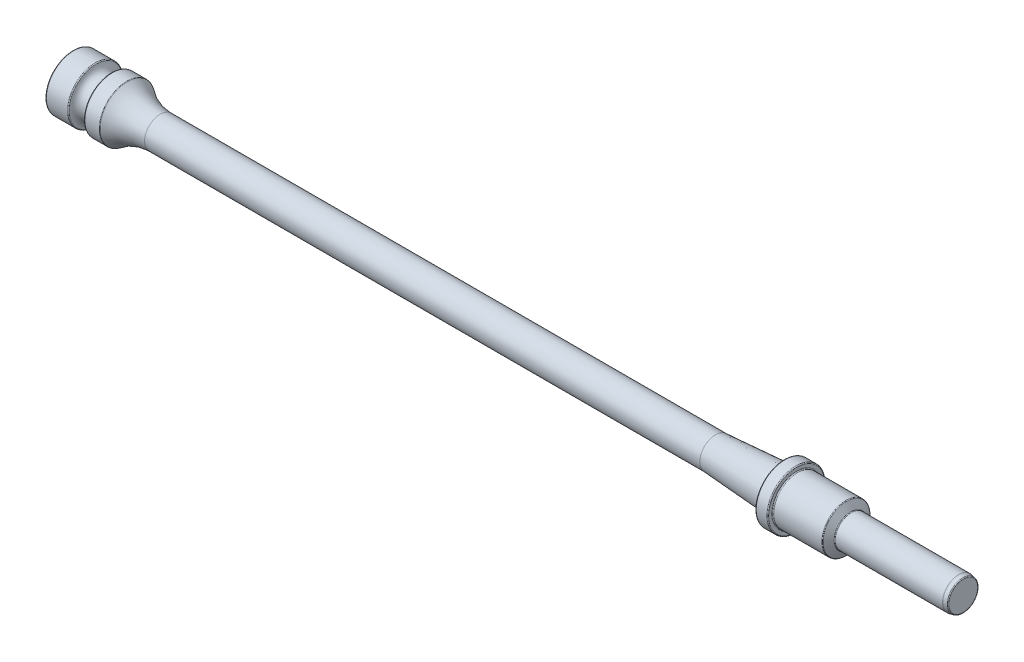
from build123d import *


with BuildPart() as part:
    # Sketch1 → Revolve1 (revolve)
    with BuildSketch(Plane.XY, mode=Mode.PRIVATE) as revolve1_sk:
        with BuildLine():
            Line((19, 3.4), (139.993340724, 3.4))
            ThreePointArc((139.993340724, 3.4), (139.999996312, 3.400110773), (140.006644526, 3.400442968))
            Line((140.006644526, 3.400442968), (154.813303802, 4.387553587))
            ThreePointArc((154.813303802, 4.387553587), (154.946049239, 4.450473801), (155, 4.587110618))
            Line((155, 4.587110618), (155, 6.1))
            ThreePointArc((155, 6.1), (155.058578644, 6.241421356), (155.2, 6.3))
            Line((155.2, 6.3), (157.5, 6.3))
            ThreePointArc((157.5, 6.3), (157.641421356, 6.241421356), (157.7, 6.1))
            Line((157.7, 6.1), (157.7, 5.4))
            ThreePointArc((157.7, 5.4), (157.758578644, 5.258578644), (157.9, 5.2))
            Line((157.9, 5.2), (168.385610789, 5.2))
            ThreePointArc((168.385610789, 5.2), (168.484906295, 5.173609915), (168.557997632, 5.101404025))
            Line((168.557997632, 5.101404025), (169.442002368, 3.598595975))
            ThreePointArc((169.442002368, 3.598595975), (169.515093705, 3.526390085), (169.614389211, 3.5))
            Line((169.614389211, 3.5), (192.980196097, 3.5))
            ThreePointArc((192.980196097, 3.5), (192.999903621, 3.499026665), (193.019419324, 3.496116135))
            Line((193.019419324, 3.496116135), (193.839223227, 3.332155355))
            ThreePointArc((193.839223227, 3.332155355), (193.954668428, 3.262837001), (194, 3.136039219))
            Line((194, 3.136039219), (194, 0))
            Line((194, 0), (0, 0))
            Line((0, 0), (0, 5.8))
            ThreePointArc((0, 5.8), (0.058578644, 5.941421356), (0.2, 6))
            Line((0.2, 6), (4.810555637, 6))
            ThreePointArc((4.810555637, 6), (4.944326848, 5.948678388), (5.009444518, 5.821052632))
            ThreePointArc((5.009444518, 5.821052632), (6.7, 4.3), (8.390555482, 5.821052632))
            ThreePointArc((8.390555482, 5.821052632), (8.455673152, 5.948678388), (8.589444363, 6))
            Line((8.589444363, 6), (11.728136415, 6))
            ThreePointArc((11.728136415, 6), (11.795470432, 5.988324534), (11.854942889, 5.954661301))
            ThreePointArc((11.854942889, 5.954661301), (15.205987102, 4.057867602), (19, 3.4))
        make_face()
    revolve(revolve1_sk.sketch.rotate(Axis((0, 0, 0), (1, 0, 0)), 90), axis=Axis((0, 0, 0), (1, 0, 0)))


solid = part.part
